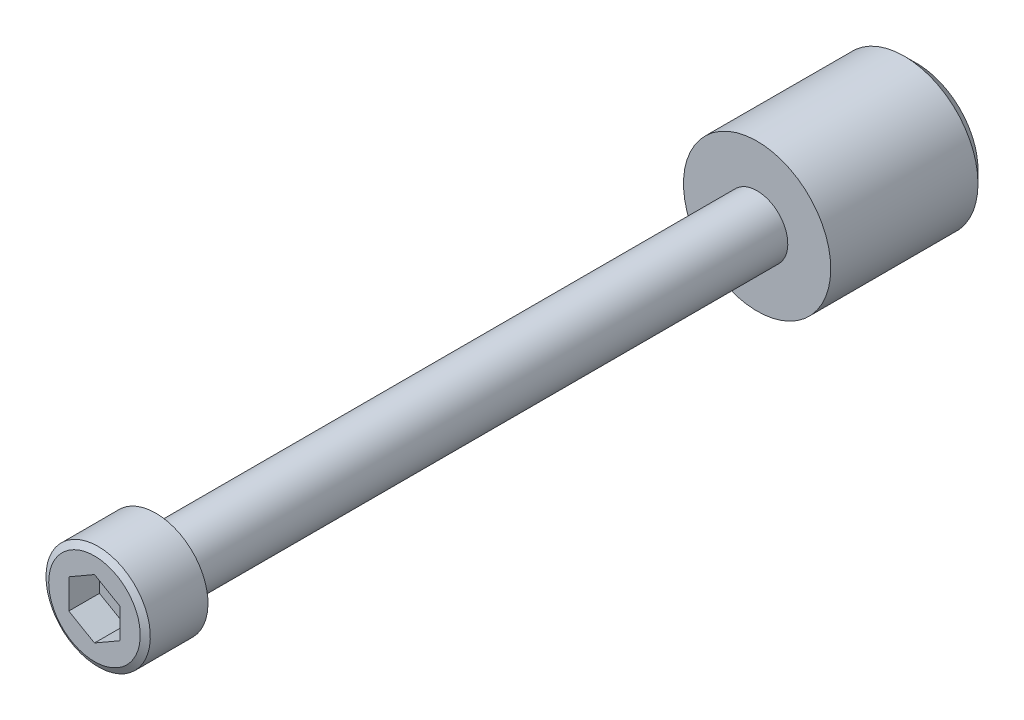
ISO-10303-21;
HEADER;
FILE_DESCRIPTION(('STEP AP214'),'2;1');
FILE_NAME('part.step','',(''),(''),'','','');
FILE_SCHEMA(('AUTOMOTIVE_DESIGN { 1 0 10303 214 1 1 1 1 }'));
ENDSEC;
DATA;
#1=APPLICATION_CONTEXT('core data for automotive mechanical design processes');
#2=APPLICATION_PROTOCOL_DEFINITION('international standard','automotive_design',2000,#1);
#3=PRODUCT_CONTEXT('',#1,'mechanical');
#4=PRODUCT('Part','Part','',(#3));
#5=PRODUCT_RELATED_PRODUCT_CATEGORY('part','',(#4));
#6=PRODUCT_DEFINITION_FORMATION('','',#4);
#7=PRODUCT_DEFINITION_CONTEXT('part definition',#1,'design');
#8=PRODUCT_DEFINITION('design','',#6,#7);
#9=PRODUCT_DEFINITION_SHAPE('','',#8);
#10=(LENGTH_UNIT() NAMED_UNIT(*) SI_UNIT(.MILLI.,.METRE.));
#11=(NAMED_UNIT(*) PLANE_ANGLE_UNIT() SI_UNIT($,.RADIAN.));
#12=(NAMED_UNIT(*) SI_UNIT($,.STERADIAN.) SOLID_ANGLE_UNIT());
#13=UNCERTAINTY_MEASURE_WITH_UNIT(LENGTH_MEASURE(1.E-05),#10,'distance_accuracy_value','');
#14=(GEOMETRIC_REPRESENTATION_CONTEXT(3) GLOBAL_UNCERTAINTY_ASSIGNED_CONTEXT((#13)) GLOBAL_UNIT_ASSIGNED_CONTEXT((#10,
#11,#12)) REPRESENTATION_CONTEXT('',''));
#15=CARTESIAN_POINT('',(0.,0.,0.));
#16=DIRECTION('',(0.,0.,1.));
#17=DIRECTION('',(1.,0.,0.));
#18=AXIS2_PLACEMENT_3D('',#15,#16,#17);
#19=CARTESIAN_POINT('',(6.072,-6.092893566,0.));
#20=DIRECTION('',(0.,0.,-1.));
#21=DIRECTION('',(-1.,0.,0.));
#22=AXIS2_PLACEMENT_3D('',#19,#20,#21);
#23=PLANE('',#22);
#24=CARTESIAN_POINT('',(0.,0.,0.));
#25=DIRECTION('',(0.,0.,-1.));
#26=DIRECTION('',(-1.,0.,0.));
#27=AXIS2_PLACEMENT_3D('',#24,#25,#26);
#28=CIRCLE('',#27,5.);
#29=CARTESIAN_POINT('',(-5.,0.,0.));
#30=VERTEX_POINT('',#29);
#31=EDGE_CURVE('E9',#30,#30,#28,.T.);
#32=ORIENTED_EDGE('',*,*,#31,.T.);
#33=EDGE_LOOP('',(#32));
#34=FACE_BOUND('',#33,.T.);
#35=ADVANCED_FACE('F14',(#34),#23,.T.);
#36=CARTESIAN_POINT('',(0.,0.,0.));
#37=DIRECTION('',(0.,0.,1.));
#38=DIRECTION('',(1.,0.,0.));
#39=AXIS2_PLACEMENT_3D('',#36,#37,#38);
#40=CYLINDRICAL_SURFACE('',#39,6.);
#41=CARTESIAN_POINT('',(0.,0.,1.00000000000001));
#42=DIRECTION('',(0.,0.,-1.));
#43=DIRECTION('',(-1.,0.,0.));
#44=AXIS2_PLACEMENT_3D('',#41,#42,#43);
#45=CIRCLE('',#44,6.);
#46=CARTESIAN_POINT('',(-6.,0.,1.00000000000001));
#47=VERTEX_POINT('',#46);
#48=EDGE_CURVE('E22',#47,#47,#45,.F.);
#49=ORIENTED_EDGE('',*,*,#48,.T.);
#50=EDGE_LOOP('',(#49));
#51=FACE_BOUND('',#50,.T.);
#52=CARTESIAN_POINT('',(0.,0.,13.));
#53=DIRECTION('',(0.,0.,1.));
#54=DIRECTION('',(1.,0.,0.));
#55=AXIS2_PLACEMENT_3D('',#52,#53,#54);
#56=CIRCLE('',#55,6.);
#57=CARTESIAN_POINT('',(6.,0.,13.));
#58=VERTEX_POINT('',#57);
#59=EDGE_CURVE('E116',#58,#58,#56,.T.);
#60=ORIENTED_EDGE('',*,*,#59,.F.);
#61=EDGE_LOOP('',(#60));
#62=FACE_BOUND('',#61,.T.);
#63=ADVANCED_FACE('F141',(#51,#62),#40,.T.);
#64=CARTESIAN_POINT('',(-6.072,-6.09289356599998,13.));
#65=DIRECTION('',(0.,0.,1.));
#66=DIRECTION('',(1.,0.,0.));
#67=AXIS2_PLACEMENT_3D('',#64,#65,#66);
#68=PLANE('',#67);
#69=CARTESIAN_POINT('',(0.,0.,13.));
#70=DIRECTION('',(0.,0.,1.));
#71=DIRECTION('',(0.,1.,0.));
#72=AXIS2_PLACEMENT_3D('',#69,#70,#71);
#73=CIRCLE('',#72,2.5);
#74=CARTESIAN_POINT('',(0.,2.50000000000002,13.));
#75=VERTEX_POINT('',#74);
#76=EDGE_CURVE('E134',#75,#75,#73,.T.);
#77=ORIENTED_EDGE('',*,*,#76,.F.);
#78=EDGE_LOOP('',(#77));
#79=FACE_BOUND('',#78,.T.);
#80=ORIENTED_EDGE('',*,*,#59,.T.);
#81=EDGE_LOOP('',(#80));
#82=FACE_BOUND('',#81,.T.);
#83=ADVANCED_FACE('F167',(#79,#82),#68,.T.);
#84=CARTESIAN_POINT('',(0.,0.,13.));
#85=DIRECTION('',(0.,0.,1.));
#86=DIRECTION('',(0.,1.,0.));
#87=AXIS2_PLACEMENT_3D('',#84,#85,#86);
#88=CYLINDRICAL_SURFACE('',#87,2.5);
#89=ORIENTED_EDGE('',*,*,#76,.T.);
#90=EDGE_LOOP('',(#89));
#91=FACE_BOUND('',#90,.T.);
#92=CARTESIAN_POINT('',(0.,0.,62.));
#93=DIRECTION('',(0.,0.,1.));
#94=DIRECTION('',(0.,1.,0.));
#95=AXIS2_PLACEMENT_3D('',#92,#93,#94);
#96=CIRCLE('',#95,2.5);
#97=CARTESIAN_POINT('',(0.,2.50000000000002,62.));
#98=VERTEX_POINT('',#97);
#99=EDGE_CURVE('E131',#98,#98,#96,.T.);
#100=ORIENTED_EDGE('',*,*,#99,.F.);
#101=EDGE_LOOP('',(#100));
#102=FACE_BOUND('',#101,.T.);
#103=ADVANCED_FACE('F173',(#91,#102),#88,.T.);
#104=CARTESIAN_POINT('',(4.301,-4.31579960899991,62.));
#105=DIRECTION('',(0.,0.,-1.));
#106=DIRECTION('',(-1.,0.,0.));
#107=AXIS2_PLACEMENT_3D('',#104,#105,#106);
#108=PLANE('',#107);
#109=ORIENTED_EDGE('',*,*,#99,.T.);
#110=EDGE_LOOP('',(#109));
#111=FACE_BOUND('',#110,.T.);
#112=CARTESIAN_POINT('',(0.,0.,62.));
#113=DIRECTION('',(0.,0.,1.));
#114=DIRECTION('',(0.,1.,0.));
#115=AXIS2_PLACEMENT_3D('',#112,#113,#114);
#116=CIRCLE('',#115,4.25);
#117=CARTESIAN_POINT('',(0.,4.25000000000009,62.));
#118=VERTEX_POINT('',#117);
#119=EDGE_CURVE('E128',#118,#118,#116,.T.);
#120=ORIENTED_EDGE('',*,*,#119,.F.);
#121=EDGE_LOOP('',(#120));
#122=FACE_BOUND('',#121,.T.);
#123=ADVANCED_FACE('F175',(#111,#122),#108,.T.);
#124=CARTESIAN_POINT('',(-3.775149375,-3.7881395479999,67.));
#125=DIRECTION('',(0.,0.,1.));
#126=DIRECTION('',(1.,0.,0.));
#127=AXIS2_PLACEMENT_3D('',#124,#125,#126);
#128=PLANE('',#127);
#129=DIRECTION('',(-0.866025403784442,0.5,0.));
#130=VECTOR('',#129,1.);
#131=CARTESIAN_POINT('',(2.09178134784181,1.20769052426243,67.));
#132=LINE('',#131,#130);
#133=CARTESIAN_POINT('',(2.09178134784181,1.20769052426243,67.));
#134=VERTEX_POINT('',#133);
#135=CARTESIAN_POINT('',(0.,2.41538104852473,67.));
#136=VERTEX_POINT('',#135);
#137=EDGE_CURVE('E29',#134,#136,#132,.T.);
#138=ORIENTED_EDGE('',*,*,#137,.F.);
#139=DIRECTION('',(0.,1.,0.));
#140=VECTOR('',#139,1.);
#141=CARTESIAN_POINT('',(2.09178134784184,-1.2076905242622,67.));
#142=LINE('',#141,#140);
#143=CARTESIAN_POINT('',(2.09178134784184,-1.2076905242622,67.));
#144=VERTEX_POINT('',#143);
#145=EDGE_CURVE('E112',#144,#134,#142,.T.);
#146=ORIENTED_EDGE('',*,*,#145,.F.);
#147=DIRECTION('',(0.866025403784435,0.500000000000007,0.));
#148=VECTOR('',#147,1.);
#149=CARTESIAN_POINT('',(0.,-2.41538104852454,67.));
#150=LINE('',#149,#148);
#151=CARTESIAN_POINT('',(0.,-2.41538104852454,67.));
#152=VERTEX_POINT('',#151);
#153=EDGE_CURVE('E110',#152,#144,#150,.T.);
#154=ORIENTED_EDGE('',*,*,#153,.F.);
#155=DIRECTION('',(0.866025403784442,-0.5,0.));
#156=VECTOR('',#155,1.);
#157=CARTESIAN_POINT('',(-2.09178134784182,-1.20769052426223,67.));
#158=LINE('',#157,#156);
#159=CARTESIAN_POINT('',(-2.09178134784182,-1.20769052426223,67.));
#160=VERTEX_POINT('',#159);
#161=EDGE_CURVE('E77',#160,#152,#158,.T.);
#162=ORIENTED_EDGE('',*,*,#161,.F.);
#163=DIRECTION('',(0.,-1.,0.));
#164=VECTOR('',#163,1.);
#165=CARTESIAN_POINT('',(-2.09178134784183,1.2076905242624,67.));
#166=LINE('',#165,#164);
#167=CARTESIAN_POINT('',(-2.09178134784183,1.2076905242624,67.));
#168=VERTEX_POINT('',#167);
#169=EDGE_CURVE('E106',#168,#160,#166,.T.);
#170=ORIENTED_EDGE('',*,*,#169,.F.);
#171=DIRECTION('',(-0.866025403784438,-0.5,0.));
#172=VECTOR('',#171,1.);
#173=CARTESIAN_POINT('',(0.,2.41538104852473,67.));
#174=LINE('',#173,#172);
#175=EDGE_CURVE('E103',#136,#168,#174,.T.);
#176=ORIENTED_EDGE('',*,*,#175,.F.);
#177=EDGE_LOOP('',(#138,#146,#154,#162,#170,#176));
#178=FACE_BOUND('',#177,.T.);
#179=CARTESIAN_POINT('',(0.,0.,67.));
#180=DIRECTION('',(0.,0.,-1.));
#181=DIRECTION('',(-1.,0.,0.));
#182=AXIS2_PLACEMENT_3D('',#179,#180,#181);
#183=CIRCLE('',#182,3.730384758);
#184=CARTESIAN_POINT('',(-3.730384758,0.,67.));
#185=VERTEX_POINT('',#184);
#186=EDGE_CURVE('E125',#185,#185,#183,.T.);
#187=ORIENTED_EDGE('',*,*,#186,.F.);
#188=EDGE_LOOP('',(#187));
#189=FACE_BOUND('',#188,.T.);
#190=ADVANCED_FACE('F177',(#178,#189),#128,.T.);
#191=CARTESIAN_POINT('',(0.,0.,62.));
#192=DIRECTION('',(0.,0.,1.));
#193=DIRECTION('',(0.,1.,0.));
#194=AXIS2_PLACEMENT_3D('',#191,#192,#193);
#195=CYLINDRICAL_SURFACE('',#194,4.25);
#196=CARTESIAN_POINT('',(0.,0.,66.7));
#197=DIRECTION('',(0.,0.,-1.));
#198=DIRECTION('',(-1.,0.,0.));
#199=AXIS2_PLACEMENT_3D('',#196,#197,#198);
#200=CIRCLE('',#199,4.25);
#201=CARTESIAN_POINT('',(-4.25,0.,66.7));
#202=VERTEX_POINT('',#201);
#203=EDGE_CURVE('E122',#202,#202,#200,.F.);
#204=ORIENTED_EDGE('',*,*,#203,.F.);
#205=EDGE_LOOP('',(#204));
#206=FACE_BOUND('',#205,.T.);
#207=ORIENTED_EDGE('',*,*,#119,.T.);
#208=EDGE_LOOP('',(#207));
#209=FACE_BOUND('',#208,.T.);
#210=ADVANCED_FACE('F156',(#206,#209),#195,.T.);
#211=CARTESIAN_POINT('',(0.,0.,67.));
#212=DIRECTION('',(0.,0.,-1.));
#213=DIRECTION('',(-1.,0.,0.));
#214=AXIS2_PLACEMENT_3D('',#211,#212,#213);
#215=CONICAL_SURFACE('',#214,3.730384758,1.04719755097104);
#216=ORIENTED_EDGE('',*,*,#203,.T.);
#217=EDGE_LOOP('',(#216));
#218=FACE_BOUND('',#217,.T.);
#219=ORIENTED_EDGE('',*,*,#186,.T.);
#220=EDGE_LOOP('',(#219));
#221=FACE_BOUND('',#220,.T.);
#222=ADVANCED_FACE('F146',(#218,#221),#215,.T.);
#223=CARTESIAN_POINT('',(0.,0.,1.00000000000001));
#224=DIRECTION('',(0.,0.,1.));
#225=DIRECTION('',(1.,0.,0.));
#226=AXIS2_PLACEMENT_3D('',#223,#224,#225);
#227=CONICAL_SURFACE('',#226,6.,0.785398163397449);
#228=ORIENTED_EDGE('',*,*,#31,.F.);
#229=EDGE_LOOP('',(#228));
#230=FACE_BOUND('',#229,.T.);
#231=ORIENTED_EDGE('',*,*,#48,.F.);
#232=EDGE_LOOP('',(#231));
#233=FACE_BOUND('',#232,.T.);
#234=ADVANCED_FACE('F16',(#230,#233),#227,.T.);
#235=CARTESIAN_POINT('',(2.09178134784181,1.20769052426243,64.5));
#236=DIRECTION('',(0.5,0.866025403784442,0.));
#237=DIRECTION('',(-0.866025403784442,0.5,0.));
#238=AXIS2_PLACEMENT_3D('',#235,#236,#237);
#239=PLANE('',#238);
#240=ORIENTED_EDGE('',*,*,#137,.T.);
#241=DIRECTION('',(0.,0.,1.));
#242=VECTOR('',#241,1.);
#243=CARTESIAN_POINT('',(0.,2.41538104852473,64.5));
#244=LINE('',#243,#242);
#245=CARTESIAN_POINT('',(0.,2.41538104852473,64.5));
#246=VERTEX_POINT('',#245);
#247=EDGE_CURVE('E59',#246,#136,#244,.T.);
#248=ORIENTED_EDGE('',*,*,#247,.F.);
#249=DIRECTION('',(-0.866025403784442,0.5,0.));
#250=VECTOR('',#249,1.);
#251=CARTESIAN_POINT('',(2.09178134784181,1.20769052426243,64.5));
#252=LINE('',#251,#250);
#253=CARTESIAN_POINT('',(2.09178134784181,1.20769052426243,64.5));
#254=VERTEX_POINT('',#253);
#255=EDGE_CURVE('E114',#254,#246,#252,.T.);
#256=ORIENTED_EDGE('',*,*,#255,.F.);
#257=DIRECTION('',(0.,0.,1.));
#258=VECTOR('',#257,1.);
#259=CARTESIAN_POINT('',(2.09178134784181,1.20769052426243,64.5));
#260=LINE('',#259,#258);
#261=EDGE_CURVE('E37',#254,#134,#260,.T.);
#262=ORIENTED_EDGE('',*,*,#261,.T.);
#263=EDGE_LOOP('',(#240,#248,#256,#262));
#264=FACE_BOUND('',#263,.T.);
#265=ADVANCED_FACE('F145',(#264),#239,.F.);
#266=CARTESIAN_POINT('',(2.09178134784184,-1.20769052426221,64.5));
#267=DIRECTION('',(1.,0.,0.));
#268=DIRECTION('',(0.,1.,0.));
#269=AXIS2_PLACEMENT_3D('',#266,#267,#268);
#270=PLANE('',#269);
#271=ORIENTED_EDGE('',*,*,#145,.T.);
#272=ORIENTED_EDGE('',*,*,#261,.F.);
#273=DIRECTION('',(0.,1.,0.));
#274=VECTOR('',#273,1.);
#275=CARTESIAN_POINT('',(2.09178134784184,-1.20769052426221,64.5));
#276=LINE('',#275,#274);
#277=CARTESIAN_POINT('',(2.09178134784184,-1.20769052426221,64.5));
#278=VERTEX_POINT('',#277);
#279=EDGE_CURVE('E89',#278,#254,#276,.T.);
#280=ORIENTED_EDGE('',*,*,#279,.F.);
#281=DIRECTION('',(0.,0.,1.));
#282=VECTOR('',#281,1.);
#283=CARTESIAN_POINT('',(2.09178134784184,-1.20769052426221,64.5));
#284=LINE('',#283,#282);
#285=EDGE_CURVE('E81',#278,#144,#284,.T.);
#286=ORIENTED_EDGE('',*,*,#285,.T.);
#287=EDGE_LOOP('',(#271,#272,#280,#286));
#288=FACE_BOUND('',#287,.T.);
#289=ADVANCED_FACE('F154',(#288),#270,.F.);
#290=CARTESIAN_POINT('',(0.,-2.41538104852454,64.5));
#291=DIRECTION('',(0.500000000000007,-0.866025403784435,0.));
#292=DIRECTION('',(0.866025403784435,0.500000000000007,0.));
#293=AXIS2_PLACEMENT_3D('',#290,#291,#292);
#294=PLANE('',#293);
#295=ORIENTED_EDGE('',*,*,#153,.T.);
#296=ORIENTED_EDGE('',*,*,#285,.F.);
#297=DIRECTION('',(0.866025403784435,0.500000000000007,0.));
#298=VECTOR('',#297,1.);
#299=CARTESIAN_POINT('',(0.,-2.41538104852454,64.5));
#300=LINE('',#299,#298);
#301=CARTESIAN_POINT('',(0.,-2.41538104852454,64.5));
#302=VERTEX_POINT('',#301);
#303=EDGE_CURVE('E85',#302,#278,#300,.T.);
#304=ORIENTED_EDGE('',*,*,#303,.F.);
#305=DIRECTION('',(0.,0.,1.));
#306=VECTOR('',#305,1.);
#307=CARTESIAN_POINT('',(0.,-2.41538104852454,64.5));
#308=LINE('',#307,#306);
#309=EDGE_CURVE('E70',#302,#152,#308,.T.);
#310=ORIENTED_EDGE('',*,*,#309,.T.);
#311=EDGE_LOOP('',(#295,#296,#304,#310));
#312=FACE_BOUND('',#311,.T.);
#313=ADVANCED_FACE('F86',(#312),#294,.F.);
#314=CARTESIAN_POINT('',(-2.09178134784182,-1.20769052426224,64.5));
#315=DIRECTION('',(-0.5,-0.866025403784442,0.));
#316=DIRECTION('',(0.866025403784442,-0.5,0.));
#317=AXIS2_PLACEMENT_3D('',#314,#315,#316);
#318=PLANE('',#317);
#319=ORIENTED_EDGE('',*,*,#161,.T.);
#320=ORIENTED_EDGE('',*,*,#309,.F.);
#321=DIRECTION('',(0.866025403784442,-0.5,0.));
#322=VECTOR('',#321,1.);
#323=CARTESIAN_POINT('',(-2.09178134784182,-1.20769052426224,64.5));
#324=LINE('',#323,#322);
#325=CARTESIAN_POINT('',(-2.09178134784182,-1.20769052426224,64.5));
#326=VERTEX_POINT('',#325);
#327=EDGE_CURVE('E74',#326,#302,#324,.T.);
#328=ORIENTED_EDGE('',*,*,#327,.F.);
#329=DIRECTION('',(0.,0.,1.));
#330=VECTOR('',#329,1.);
#331=CARTESIAN_POINT('',(-2.09178134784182,-1.20769052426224,64.5));
#332=LINE('',#331,#330);
#333=EDGE_CURVE('E82',#326,#160,#332,.T.);
#334=ORIENTED_EDGE('',*,*,#333,.T.);
#335=EDGE_LOOP('',(#319,#320,#328,#334));
#336=FACE_BOUND('',#335,.T.);
#337=ADVANCED_FACE('F72',(#336),#318,.F.);
#338=CARTESIAN_POINT('',(-2.09178134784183,1.2076905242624,64.5));
#339=DIRECTION('',(-1.,0.,0.));
#340=DIRECTION('',(0.,-1.,0.));
#341=AXIS2_PLACEMENT_3D('',#338,#339,#340);
#342=PLANE('',#341);
#343=ORIENTED_EDGE('',*,*,#169,.T.);
#344=ORIENTED_EDGE('',*,*,#333,.F.);
#345=DIRECTION('',(0.,-1.,0.));
#346=VECTOR('',#345,1.);
#347=CARTESIAN_POINT('',(-2.09178134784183,1.2076905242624,64.5));
#348=LINE('',#347,#346);
#349=CARTESIAN_POINT('',(-2.09178134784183,1.2076905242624,64.5));
#350=VERTEX_POINT('',#349);
#351=EDGE_CURVE('E95',#350,#326,#348,.T.);
#352=ORIENTED_EDGE('',*,*,#351,.F.);
#353=DIRECTION('',(0.,0.,1.));
#354=VECTOR('',#353,1.);
#355=CARTESIAN_POINT('',(-2.09178134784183,1.2076905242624,64.5));
#356=LINE('',#355,#354);
#357=EDGE_CURVE('E119',#350,#168,#356,.T.);
#358=ORIENTED_EDGE('',*,*,#357,.T.);
#359=EDGE_LOOP('',(#343,#344,#352,#358));
#360=FACE_BOUND('',#359,.T.);
#361=ADVANCED_FACE('F206',(#360),#342,.F.);
#362=CARTESIAN_POINT('',(0.,2.41538104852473,64.5));
#363=DIRECTION('',(-0.5,0.866025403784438,0.));
#364=DIRECTION('',(-0.866025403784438,-0.5,0.));
#365=AXIS2_PLACEMENT_3D('',#362,#363,#364);
#366=PLANE('',#365);
#367=ORIENTED_EDGE('',*,*,#175,.T.);
#368=ORIENTED_EDGE('',*,*,#357,.F.);
#369=DIRECTION('',(-0.866025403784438,-0.5,0.));
#370=VECTOR('',#369,1.);
#371=CARTESIAN_POINT('',(0.,2.41538104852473,64.5));
#372=LINE('',#371,#370);
#373=EDGE_CURVE('E97',#246,#350,#372,.T.);
#374=ORIENTED_EDGE('',*,*,#373,.F.);
#375=ORIENTED_EDGE('',*,*,#247,.T.);
#376=EDGE_LOOP('',(#367,#368,#374,#375));
#377=FACE_BOUND('',#376,.T.);
#378=ADVANCED_FACE('F193',(#377),#366,.F.);
#379=CARTESIAN_POINT('',(0.,2.41538104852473,64.5));
#380=DIRECTION('',(0.,0.,1.));
#381=DIRECTION('',(1.,0.,0.));
#382=AXIS2_PLACEMENT_3D('',#379,#380,#381);
#383=PLANE('',#382);
#384=ORIENTED_EDGE('',*,*,#255,.T.);
#385=ORIENTED_EDGE('',*,*,#373,.T.);
#386=ORIENTED_EDGE('',*,*,#351,.T.);
#387=ORIENTED_EDGE('',*,*,#327,.T.);
#388=ORIENTED_EDGE('',*,*,#303,.T.);
#389=ORIENTED_EDGE('',*,*,#279,.T.);
#390=EDGE_LOOP('',(#384,#385,#386,#387,#388,#389));
#391=FACE_BOUND('',#390,.T.);
#392=ADVANCED_FACE('F92',(#391),#383,.T.);
#393=CLOSED_SHELL('',(#35,#63,#83,#103,#123,#190,#210,#222,#234,#265,#289,#313,#337,#361,#378,#392));
#394=MANIFOLD_SOLID_BREP('B1',#393);
#395=ADVANCED_BREP_SHAPE_REPRESENTATION('',(#18,#394),#14);
#396=SHAPE_DEFINITION_REPRESENTATION(#9,#395);
ENDSEC;
END-ISO-10303-21;
